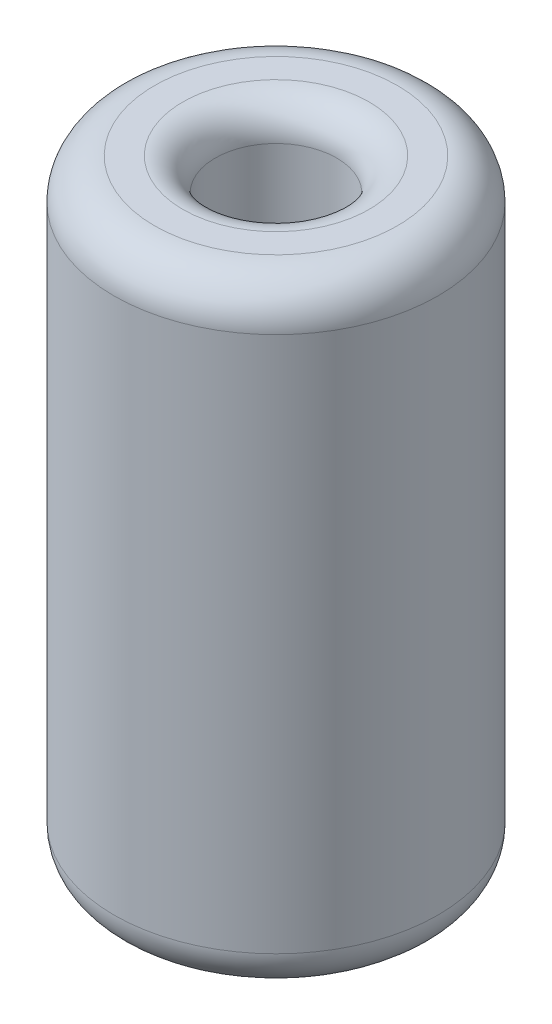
from build123d import *


with BuildPart() as part:
    # Sketch1 → Revolve1 (revolve)
    with BuildSketch(Plane.XY, mode=Mode.PRIVATE) as revolve1_sk:
        with BuildLine():
            Line((0.75, 7.22), (0.75, 0.4))
            ThreePointArc((0.75, 0.4), (0.867157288, 0.117157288), (1.15, 0))
            Line((1.15, 0), (1.5, 0))
            ThreePointArc((1.5, 0), (1.853553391, 0.146446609), (2, 0.5))
            Line((2, 0.5), (2, 7.12))
            ThreePointArc((2, 7.12), (1.853553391, 7.473553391), (1.5, 7.62))
            Line((1.5, 7.62), (1.15, 7.62))
            ThreePointArc((1.15, 7.62), (0.867157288, 7.502842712), (0.75, 7.22))
        make_face()
    revolve(revolve1_sk.sketch.rotate(Axis((0, 0, 0), (0, 1, 0)), 90), axis=Axis((0, 0, 0), (0, 1, 0)))


solid = part.part
